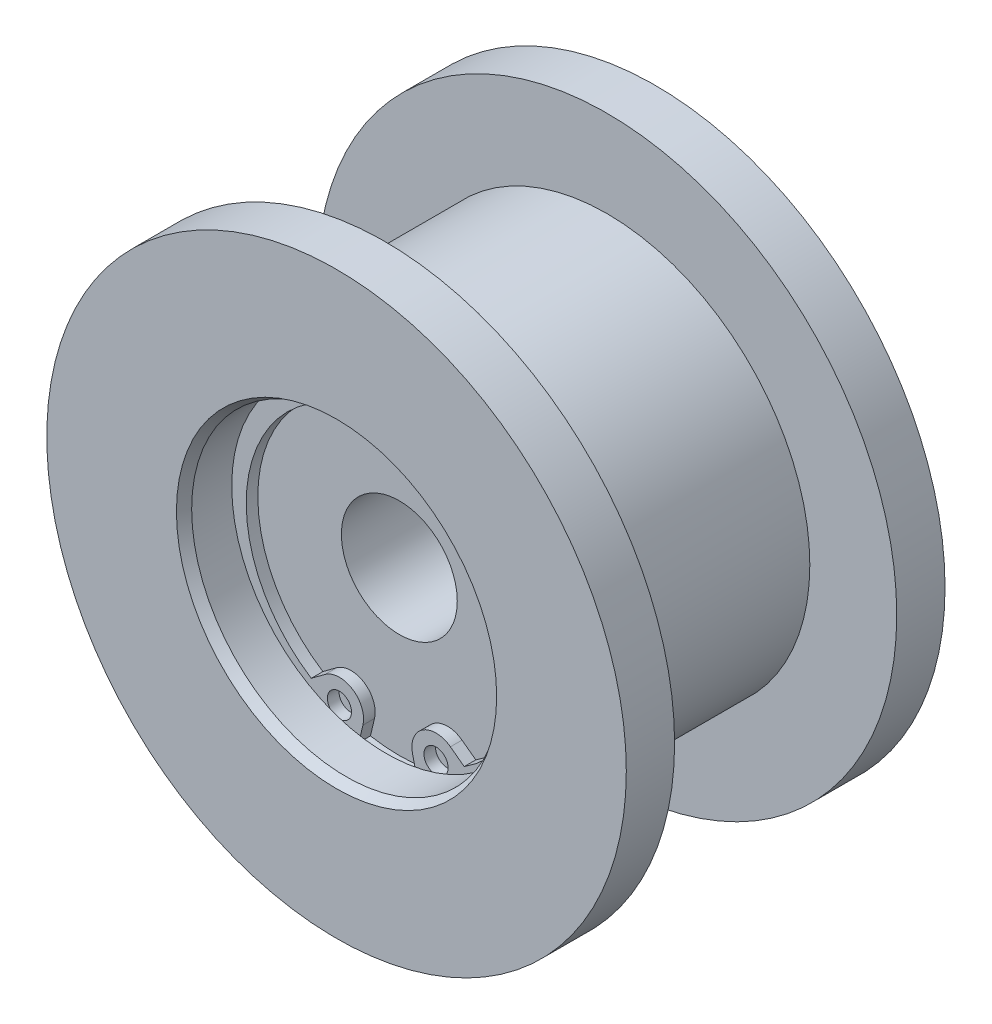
ISO-10303-21;
HEADER;
FILE_DESCRIPTION(('STEP AP214'),'2;1');
FILE_NAME('part.step','',(''),(''),'','','');
FILE_SCHEMA(('AUTOMOTIVE_DESIGN { 1 0 10303 214 1 1 1 1 }'));
ENDSEC;
DATA;
#1=APPLICATION_CONTEXT('core data for automotive mechanical design processes');
#2=APPLICATION_PROTOCOL_DEFINITION('international standard','automotive_design',2000,#1);
#3=PRODUCT_CONTEXT('',#1,'mechanical');
#4=PRODUCT('Part','Part','',(#3));
#5=PRODUCT_RELATED_PRODUCT_CATEGORY('part','',(#4));
#6=PRODUCT_DEFINITION_FORMATION('','',#4);
#7=PRODUCT_DEFINITION_CONTEXT('part definition',#1,'design');
#8=PRODUCT_DEFINITION('design','',#6,#7);
#9=PRODUCT_DEFINITION_SHAPE('','',#8);
#10=(LENGTH_UNIT() NAMED_UNIT(*) SI_UNIT(.MILLI.,.METRE.));
#11=(NAMED_UNIT(*) PLANE_ANGLE_UNIT() SI_UNIT($,.RADIAN.));
#12=(NAMED_UNIT(*) SI_UNIT($,.STERADIAN.) SOLID_ANGLE_UNIT());
#13=UNCERTAINTY_MEASURE_WITH_UNIT(LENGTH_MEASURE(1.E-05),#10,'distance_accuracy_value','');
#14=(GEOMETRIC_REPRESENTATION_CONTEXT(3) GLOBAL_UNCERTAINTY_ASSIGNED_CONTEXT((#13)) GLOBAL_UNIT_ASSIGNED_CONTEXT((#10,
#11,#12)) REPRESENTATION_CONTEXT('',''));
#15=CARTESIAN_POINT('',(0.,0.,0.));
#16=DIRECTION('',(0.,0.,1.));
#17=DIRECTION('',(1.,0.,0.));
#18=AXIS2_PLACEMENT_3D('',#15,#16,#17);
#19=CARTESIAN_POINT('',(0.,-0.95,11.2));
#20=DIRECTION('',(0.,0.,1.));
#21=DIRECTION('',(-1.,0.,0.));
#22=AXIS2_PLACEMENT_3D('',#19,#20,#21);
#23=CYLINDRICAL_SURFACE('',#22,14.65);
#24=CARTESIAN_POINT('',(0.,-0.95,10.));
#25=DIRECTION('',(0.,0.,-1.));
#26=DIRECTION('',(0.,-1.,0.));
#27=AXIS2_PLACEMENT_3D('',#24,#25,#26);
#28=CIRCLE('',#27,14.65);
#29=CARTESIAN_POINT('',(-7.91695293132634,-13.2765711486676,10.));
#30=VERTEX_POINT('',#29);
#31=CARTESIAN_POINT('',(7.91695293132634,-13.2765711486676,10.));
#32=VERTEX_POINT('',#31);
#33=EDGE_CURVE('E161',#30,#32,#28,.T.);
#34=ORIENTED_EDGE('',*,*,#33,.T.);
#35=DIRECTION('',(0.,0.,-1.));
#36=VECTOR('',#35,1.);
#37=CARTESIAN_POINT('',(7.91695293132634,-13.2765711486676,11.2));
#38=LINE('',#37,#36);
#39=CARTESIAN_POINT('',(7.91695293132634,-13.2765711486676,11.2));
#40=VERTEX_POINT('',#39);
#41=EDGE_CURVE('E101',#40,#32,#38,.T.);
#42=ORIENTED_EDGE('',*,*,#41,.F.);
#43=CARTESIAN_POINT('',(0.,-0.95,11.2));
#44=DIRECTION('',(0.,0.,-1.));
#45=DIRECTION('',(0.,-1.,0.));
#46=AXIS2_PLACEMENT_3D('',#43,#44,#45);
#47=CIRCLE('',#46,14.65);
#48=CARTESIAN_POINT('',(-7.91695293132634,-13.2765711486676,11.2));
#49=VERTEX_POINT('',#48);
#50=EDGE_CURVE('E102',#49,#40,#47,.T.);
#51=ORIENTED_EDGE('',*,*,#50,.F.);
#52=DIRECTION('',(0.,0.,-1.));
#53=VECTOR('',#52,1.);
#54=CARTESIAN_POINT('',(-7.91695293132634,-13.2765711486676,11.2));
#55=LINE('',#54,#53);
#56=EDGE_CURVE('E96',#49,#30,#55,.T.);
#57=ORIENTED_EDGE('',*,*,#56,.T.);
#58=EDGE_LOOP('',(#34,#42,#51,#57));
#59=FACE_BOUND('',#58,.T.);
#60=ADVANCED_FACE('F14',(#59),#23,.F.);
#61=CARTESIAN_POINT('',(6.49138441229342,-12.2169439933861,11.2));
#62=DIRECTION('',(-0.596553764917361,-0.802573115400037,0.));
#63=DIRECTION('',(-0.802573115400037,0.596553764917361,0.));
#64=AXIS2_PLACEMENT_3D('',#61,#62,#63);
#65=PLANE('',#64);
#66=DIRECTION('',(-0.802573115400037,0.596553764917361,0.));
#67=VECTOR('',#66,1.);
#68=CARTESIAN_POINT('',(6.49138441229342,-12.2169439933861,10.));
#69=LINE('',#68,#67);
#70=CARTESIAN_POINT('',(6.49138441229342,-12.2169439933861,10.));
#71=VERTEX_POINT('',#70);
#72=EDGE_CURVE('E145',#32,#71,#69,.T.);
#73=ORIENTED_EDGE('',*,*,#72,.T.);
#74=DIRECTION('',(0.,0.,-1.));
#75=VECTOR('',#74,1.);
#76=CARTESIAN_POINT('',(6.49138441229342,-12.2169439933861,11.2));
#77=LINE('',#76,#75);
#78=CARTESIAN_POINT('',(6.49138441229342,-12.2169439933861,11.2));
#79=VERTEX_POINT('',#78);
#80=EDGE_CURVE('E150',#79,#71,#77,.T.);
#81=ORIENTED_EDGE('',*,*,#80,.F.);
#82=DIRECTION('',(-0.802573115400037,0.596553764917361,0.));
#83=VECTOR('',#82,1.);
#84=CARTESIAN_POINT('',(6.49138441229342,-12.2169439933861,11.2));
#85=LINE('',#84,#83);
#86=EDGE_CURVE('E135',#40,#79,#85,.T.);
#87=ORIENTED_EDGE('',*,*,#86,.F.);
#88=ORIENTED_EDGE('',*,*,#41,.T.);
#89=EDGE_LOOP('',(#73,#81,#87,#88));
#90=FACE_BOUND('',#89,.T.);
#91=ADVANCED_FACE('F285',(#90),#65,.F.);
#92=CARTESIAN_POINT('',(5.,-14.2233767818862,11.2));
#93=DIRECTION('',(0.,0.,1.));
#94=DIRECTION('',(-1.,0.,0.));
#95=AXIS2_PLACEMENT_3D('',#92,#93,#94);
#96=CYLINDRICAL_SURFACE('',#95,2.5);
#97=CARTESIAN_POINT('',(5.,-14.2233767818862,10.));
#98=DIRECTION('',(0.,0.,1.));
#99=DIRECTION('',(1.,0.,0.));
#100=AXIS2_PLACEMENT_3D('',#97,#98,#99);
#101=CIRCLE('',#100,2.5);
#102=CARTESIAN_POINT('',(2.5678231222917,-14.8017500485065,10.));
#103=VERTEX_POINT('',#102);
#104=EDGE_CURVE('E131',#71,#103,#101,.T.);
#105=ORIENTED_EDGE('',*,*,#104,.T.);
#106=DIRECTION('',(0.,0.,-1.));
#107=VECTOR('',#106,1.);
#108=CARTESIAN_POINT('',(2.5678231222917,-14.8017500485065,11.2));
#109=LINE('',#108,#107);
#110=CARTESIAN_POINT('',(2.5678231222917,-14.8017500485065,11.2));
#111=VERTEX_POINT('',#110);
#112=EDGE_CURVE('E151',#111,#103,#109,.T.);
#113=ORIENTED_EDGE('',*,*,#112,.F.);
#114=CARTESIAN_POINT('',(5.,-14.2233767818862,11.2));
#115=DIRECTION('',(0.,0.,1.));
#116=DIRECTION('',(1.,0.,0.));
#117=AXIS2_PLACEMENT_3D('',#114,#115,#116);
#118=CIRCLE('',#117,2.5);
#119=EDGE_CURVE('E166',#79,#111,#118,.T.);
#120=ORIENTED_EDGE('',*,*,#119,.F.);
#121=ORIENTED_EDGE('',*,*,#80,.T.);
#122=EDGE_LOOP('',(#105,#113,#120,#121));
#123=FACE_BOUND('',#122,.T.);
#124=ADVANCED_FACE('F282',(#123),#96,.T.);
#125=CARTESIAN_POINT('',(-2.56782312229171,-14.8017500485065,11.2));
#126=DIRECTION('',(-0.97287075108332,0.231349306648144,0.));
#127=DIRECTION('',(0.,0.,1.));
#128=AXIS2_PLACEMENT_3D('',#125,#126,#127);
#129=PLANE('',#128);
#130=DIRECTION('',(0.,0.,1.));
#131=VECTOR('',#130,1.);
#132=CARTESIAN_POINT('',(-2.99125499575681,-16.5823669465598,15.1183293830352));
#133=LINE('',#132,#131);
#134=CARTESIAN_POINT('',(-2.99125499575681,-16.5823669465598,10.));
#135=VERTEX_POINT('',#134);
#136=CARTESIAN_POINT('',(-2.99125499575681,-16.5823669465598,11.2));
#137=VERTEX_POINT('',#136);
#138=EDGE_CURVE('E175',#135,#137,#133,.T.);
#139=ORIENTED_EDGE('',*,*,#138,.F.);
#140=DIRECTION('',(0.231349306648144,0.97287075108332,0.));
#141=VECTOR('',#140,1.);
#142=CARTESIAN_POINT('',(-2.56782312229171,-14.8017500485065,10.));
#143=LINE('',#142,#141);
#144=CARTESIAN_POINT('',(-2.56782312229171,-14.8017500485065,10.));
#145=VERTEX_POINT('',#144);
#146=EDGE_CURVE('E152',#135,#145,#143,.T.);
#147=ORIENTED_EDGE('',*,*,#146,.T.);
#148=DIRECTION('',(0.,0.,-1.));
#149=VECTOR('',#148,1.);
#150=CARTESIAN_POINT('',(-2.56782312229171,-14.8017500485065,11.2));
#151=LINE('',#150,#149);
#152=CARTESIAN_POINT('',(-2.56782312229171,-14.8017500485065,11.2));
#153=VERTEX_POINT('',#152);
#154=EDGE_CURVE('E171',#153,#145,#151,.T.);
#155=ORIENTED_EDGE('',*,*,#154,.F.);
#156=DIRECTION('',(0.231349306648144,0.97287075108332,0.));
#157=VECTOR('',#156,1.);
#158=CARTESIAN_POINT('',(-2.56782312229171,-14.8017500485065,11.2));
#159=LINE('',#158,#157);
#160=EDGE_CURVE('E119',#137,#153,#159,.T.);
#161=ORIENTED_EDGE('',*,*,#160,.F.);
#162=EDGE_LOOP('',(#139,#147,#155,#161));
#163=FACE_BOUND('',#162,.T.);
#164=ADVANCED_FACE('F295',(#163),#129,.F.);
#165=CARTESIAN_POINT('',(0.,-0.95,11.2));
#166=DIRECTION('',(0.,0.,-1.));
#167=DIRECTION('',(0.,-1.,0.));
#168=AXIS2_PLACEMENT_3D('',#165,#166,#167);
#169=PLANE('',#168);
#170=CARTESIAN_POINT('',(5.,-14.2233767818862,11.2));
#171=DIRECTION('',(0.,0.,1.));
#172=DIRECTION('',(1.,0.,0.));
#173=AXIS2_PLACEMENT_3D('',#170,#171,#172);
#174=CIRCLE('',#173,1.25);
#175=CARTESIAN_POINT('',(6.25,-14.2233767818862,11.2));
#176=VERTEX_POINT('',#175);
#177=EDGE_CURVE('E137',#176,#176,#174,.T.);
#178=ORIENTED_EDGE('',*,*,#177,.F.);
#179=EDGE_LOOP('',(#178));
#180=FACE_BOUND('',#179,.T.);
#181=CARTESIAN_POINT('',(-5.,-14.2233767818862,11.2));
#182=DIRECTION('',(0.,0.,-1.));
#183=DIRECTION('',(1.,0.,0.));
#184=AXIS2_PLACEMENT_3D('',#181,#182,#183);
#185=CIRCLE('',#184,1.25);
#186=CARTESIAN_POINT('',(-3.75,-14.2233767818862,11.2));
#187=VERTEX_POINT('',#186);
#188=EDGE_CURVE('E121',#187,#187,#185,.T.);
#189=ORIENTED_EDGE('',*,*,#188,.T.);
#190=EDGE_LOOP('',(#189));
#191=FACE_BOUND('',#190,.T.);
#192=CARTESIAN_POINT('',(0.,0.,11.2));
#193=DIRECTION('',(0.,0.,-1.));
#194=DIRECTION('',(-1.,0.,0.));
#195=AXIS2_PLACEMENT_3D('',#192,#193,#194);
#196=CIRCLE('',#195,16.85);
#197=CARTESIAN_POINT('',(2.99125499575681,-16.5823669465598,11.2));
#198=VERTEX_POINT('',#197);
#199=EDGE_CURVE('E9',#137,#198,#196,.T.);
#200=ORIENTED_EDGE('',*,*,#199,.F.);
#201=ORIENTED_EDGE('',*,*,#160,.T.);
#202=CARTESIAN_POINT('',(-5.,-14.2233767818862,11.2));
#203=DIRECTION('',(0.,0.,1.));
#204=DIRECTION('',(-1.,0.,0.));
#205=AXIS2_PLACEMENT_3D('',#202,#203,#204);
#206=CIRCLE('',#205,2.5);
#207=CARTESIAN_POINT('',(-6.49138441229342,-12.2169439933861,11.2));
#208=VERTEX_POINT('',#207);
#209=EDGE_CURVE('E108',#153,#208,#206,.T.);
#210=ORIENTED_EDGE('',*,*,#209,.T.);
#211=DIRECTION('',(-0.802573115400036,-0.596553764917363,0.));
#212=VECTOR('',#211,1.);
#213=CARTESIAN_POINT('',(-6.49138441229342,-12.2169439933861,11.2));
#214=LINE('',#213,#212);
#215=EDGE_CURVE('E91',#208,#49,#214,.T.);
#216=ORIENTED_EDGE('',*,*,#215,.T.);
#217=ORIENTED_EDGE('',*,*,#50,.T.);
#218=ORIENTED_EDGE('',*,*,#86,.T.);
#219=ORIENTED_EDGE('',*,*,#119,.T.);
#220=DIRECTION('',(0.231349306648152,-0.972870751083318,0.));
#221=VECTOR('',#220,1.);
#222=CARTESIAN_POINT('',(2.5678231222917,-14.8017500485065,11.2));
#223=LINE('',#222,#221);
#224=EDGE_CURVE('E127',#111,#198,#223,.T.);
#225=ORIENTED_EDGE('',*,*,#224,.T.);
#226=EDGE_LOOP('',(#200,#201,#210,#216,#217,#218,#219,#225));
#227=FACE_BOUND('',#226,.T.);
#228=ADVANCED_FACE('F117',(#180,#191,#227),#169,.F.);
#229=CARTESIAN_POINT('',(5.,-14.2233767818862,11.2));
#230=DIRECTION('',(0.,0.,1.));
#231=DIRECTION('',(-1.,0.,0.));
#232=AXIS2_PLACEMENT_3D('',#229,#230,#231);
#233=CYLINDRICAL_SURFACE('',#232,1.25);
#234=CARTESIAN_POINT('',(5.,-14.2233767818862,10.));
#235=DIRECTION('',(0.,0.,1.));
#236=DIRECTION('',(1.,0.,0.));
#237=AXIS2_PLACEMENT_3D('',#234,#235,#236);
#238=CIRCLE('',#237,1.25);
#239=CARTESIAN_POINT('',(6.25,-14.2233767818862,10.));
#240=VERTEX_POINT('',#239);
#241=EDGE_CURVE('E114',#240,#240,#238,.T.);
#242=ORIENTED_EDGE('',*,*,#241,.F.);
#243=EDGE_LOOP('',(#242));
#244=FACE_BOUND('',#243,.T.);
#245=ORIENTED_EDGE('',*,*,#177,.T.);
#246=EDGE_LOOP('',(#245));
#247=FACE_BOUND('',#246,.T.);
#248=ADVANCED_FACE('F303',(#244,#247),#233,.F.);
#249=CARTESIAN_POINT('',(-5.,-14.2233767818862,11.2));
#250=DIRECTION('',(0.,0.,1.));
#251=DIRECTION('',(-1.,0.,0.));
#252=AXIS2_PLACEMENT_3D('',#249,#250,#251);
#253=CYLINDRICAL_SURFACE('',#252,1.25);
#254=CARTESIAN_POINT('',(-5.,-14.2233767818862,10.));
#255=DIRECTION('',(0.,0.,-1.));
#256=DIRECTION('',(1.,0.,0.));
#257=AXIS2_PLACEMENT_3D('',#254,#255,#256);
#258=CIRCLE('',#257,1.25);
#259=CARTESIAN_POINT('',(-3.75,-14.2233767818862,10.));
#260=VERTEX_POINT('',#259);
#261=EDGE_CURVE('E140',#260,#260,#258,.T.);
#262=ORIENTED_EDGE('',*,*,#261,.T.);
#263=EDGE_LOOP('',(#262));
#264=FACE_BOUND('',#263,.T.);
#265=ORIENTED_EDGE('',*,*,#188,.F.);
#266=EDGE_LOOP('',(#265));
#267=FACE_BOUND('',#266,.T.);
#268=ADVANCED_FACE('F527',(#264,#267),#253,.F.);
#269=CARTESIAN_POINT('',(-6.49138441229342,-12.2169439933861,11.2));
#270=DIRECTION('',(0.596553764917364,-0.802573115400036,0.));
#271=DIRECTION('',(0.,0.,-1.));
#272=AXIS2_PLACEMENT_3D('',#269,#270,#271);
#273=PLANE('',#272);
#274=DIRECTION('',(-0.802573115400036,-0.596553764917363,0.));
#275=VECTOR('',#274,1.);
#276=CARTESIAN_POINT('',(-6.49138441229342,-12.2169439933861,10.));
#277=LINE('',#276,#275);
#278=CARTESIAN_POINT('',(-6.49138441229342,-12.2169439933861,10.));
#279=VERTEX_POINT('',#278);
#280=EDGE_CURVE('E113',#279,#30,#277,.T.);
#281=ORIENTED_EDGE('',*,*,#280,.T.);
#282=ORIENTED_EDGE('',*,*,#56,.F.);
#283=ORIENTED_EDGE('',*,*,#215,.F.);
#284=DIRECTION('',(0.,0.,-1.));
#285=VECTOR('',#284,1.);
#286=CARTESIAN_POINT('',(-6.49138441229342,-12.2169439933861,11.2));
#287=LINE('',#286,#285);
#288=EDGE_CURVE('E94',#208,#279,#287,.T.);
#289=ORIENTED_EDGE('',*,*,#288,.T.);
#290=EDGE_LOOP('',(#281,#282,#283,#289));
#291=FACE_BOUND('',#290,.T.);
#292=ADVANCED_FACE('F93',(#291),#273,.F.);
#293=CARTESIAN_POINT('',(-5.,-14.2233767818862,11.2));
#294=DIRECTION('',(0.,0.,1.));
#295=DIRECTION('',(-1.,0.,0.));
#296=AXIS2_PLACEMENT_3D('',#293,#294,#295);
#297=CYLINDRICAL_SURFACE('',#296,2.5);
#298=CARTESIAN_POINT('',(-5.,-14.2233767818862,10.));
#299=DIRECTION('',(0.,0.,1.));
#300=DIRECTION('',(-1.,0.,0.));
#301=AXIS2_PLACEMENT_3D('',#298,#299,#300);
#302=CIRCLE('',#301,2.5);
#303=EDGE_CURVE('E110',#145,#279,#302,.T.);
#304=ORIENTED_EDGE('',*,*,#303,.T.);
#305=ORIENTED_EDGE('',*,*,#288,.F.);
#306=ORIENTED_EDGE('',*,*,#209,.F.);
#307=ORIENTED_EDGE('',*,*,#154,.T.);
#308=EDGE_LOOP('',(#304,#305,#306,#307));
#309=FACE_BOUND('',#308,.T.);
#310=ADVANCED_FACE('F106',(#309),#297,.T.);
#311=CARTESIAN_POINT('',(2.5678231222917,-14.8017500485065,11.2));
#312=DIRECTION('',(0.972870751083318,0.231349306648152,0.));
#313=DIRECTION('',(0.,0.,-1.));
#314=AXIS2_PLACEMENT_3D('',#311,#312,#313);
#315=PLANE('',#314);
#316=DIRECTION('',(0.,0.,1.));
#317=VECTOR('',#316,1.);
#318=CARTESIAN_POINT('',(2.99125499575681,-16.5823669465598,15.1183293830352));
#319=LINE('',#318,#317);
#320=CARTESIAN_POINT('',(2.99125499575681,-16.5823669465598,10.));
#321=VERTEX_POINT('',#320);
#322=EDGE_CURVE('E18',#198,#321,#319,.F.);
#323=ORIENTED_EDGE('',*,*,#322,.F.);
#324=ORIENTED_EDGE('',*,*,#224,.F.);
#325=ORIENTED_EDGE('',*,*,#112,.T.);
#326=DIRECTION('',(0.231349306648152,-0.972870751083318,0.));
#327=VECTOR('',#326,1.);
#328=CARTESIAN_POINT('',(2.5678231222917,-14.8017500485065,10.));
#329=LINE('',#328,#327);
#330=EDGE_CURVE('E32',#103,#321,#329,.T.);
#331=ORIENTED_EDGE('',*,*,#330,.T.);
#332=EDGE_LOOP('',(#323,#324,#325,#331));
#333=FACE_BOUND('',#332,.T.);
#334=ADVANCED_FACE('F264',(#333),#315,.F.);
#335=CARTESIAN_POINT('',(0.,6.,10.));
#336=DIRECTION('',(0.,0.,-1.));
#337=DIRECTION('',(-1.,0.,0.));
#338=AXIS2_PLACEMENT_3D('',#335,#336,#337);
#339=PLANE('',#338);
#340=ORIENTED_EDGE('',*,*,#241,.T.);
#341=EDGE_LOOP('',(#340));
#342=FACE_BOUND('',#341,.T.);
#343=ADVANCED_FACE('F256',(#342),#339,.F.);
#344=ORIENTED_EDGE('',*,*,#261,.F.);
#345=EDGE_LOOP('',(#344));
#346=FACE_BOUND('',#345,.T.);
#347=ADVANCED_FACE('F255',(#346),#339,.F.);
#348=CARTESIAN_POINT('',(0.,0.,15.1183293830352));
#349=DIRECTION('',(0.,0.,1.));
#350=DIRECTION('',(1.,0.,0.));
#351=AXIS2_PLACEMENT_3D('',#348,#349,#350);
#352=CYLINDRICAL_SURFACE('',#351,21.);
#353=CARTESIAN_POINT('',(0.,0.,11.5));
#354=DIRECTION('',(0.,0.,1.));
#355=DIRECTION('',(1.,0.,0.));
#356=AXIS2_PLACEMENT_3D('',#353,#354,#355);
#357=CIRCLE('',#356,21.);
#358=CARTESIAN_POINT('',(21.,0.,11.5));
#359=VERTEX_POINT('',#358);
#360=EDGE_CURVE('E183',#359,#359,#357,.T.);
#361=ORIENTED_EDGE('',*,*,#360,.F.);
#362=EDGE_LOOP('',(#361));
#363=FACE_BOUND('',#362,.T.);
#364=CARTESIAN_POINT('',(0.,0.,-11.5));
#365=DIRECTION('',(0.,0.,1.));
#366=DIRECTION('',(1.,0.,0.));
#367=AXIS2_PLACEMENT_3D('',#364,#365,#366);
#368=CIRCLE('',#367,21.);
#369=CARTESIAN_POINT('',(21.,0.,-11.5));
#370=VERTEX_POINT('',#369);
#371=EDGE_CURVE('E180',#370,#370,#368,.T.);
#372=ORIENTED_EDGE('',*,*,#371,.T.);
#373=EDGE_LOOP('',(#372));
#374=FACE_BOUND('',#373,.T.);
#375=ADVANCED_FACE('F314',(#363,#374),#352,.T.);
#376=CARTESIAN_POINT('',(0.,21.,11.5));
#377=DIRECTION('',(0.,0.,1.));
#378=DIRECTION('',(1.,0.,0.));
#379=AXIS2_PLACEMENT_3D('',#376,#377,#378);
#380=PLANE('',#379);
#381=CARTESIAN_POINT('',(0.,0.,11.5));
#382=DIRECTION('',(0.,0.,1.));
#383=DIRECTION('',(1.,0.,0.));
#384=AXIS2_PLACEMENT_3D('',#381,#382,#383);
#385=CIRCLE('',#384,30.);
#386=CARTESIAN_POINT('',(30.,0.,11.5));
#387=VERTEX_POINT('',#386);
#388=EDGE_CURVE('E186',#387,#387,#385,.T.);
#389=ORIENTED_EDGE('',*,*,#388,.F.);
#390=EDGE_LOOP('',(#389));
#391=FACE_BOUND('',#390,.T.);
#392=ORIENTED_EDGE('',*,*,#360,.T.);
#393=EDGE_LOOP('',(#392));
#394=FACE_BOUND('',#393,.T.);
#395=ADVANCED_FACE('F330',(#391,#394),#380,.F.);
#396=CARTESIAN_POINT('',(0.,30.,-11.5));
#397=DIRECTION('',(0.,0.,-1.));
#398=DIRECTION('',(-1.,0.,0.));
#399=AXIS2_PLACEMENT_3D('',#396,#397,#398);
#400=PLANE('',#399);
#401=ORIENTED_EDGE('',*,*,#371,.F.);
#402=EDGE_LOOP('',(#401));
#403=FACE_BOUND('',#402,.T.);
#404=CARTESIAN_POINT('',(0.,0.,-11.5));
#405=DIRECTION('',(0.,0.,1.));
#406=DIRECTION('',(1.,0.,0.));
#407=AXIS2_PLACEMENT_3D('',#404,#405,#406);
#408=CIRCLE('',#407,30.);
#409=CARTESIAN_POINT('',(30.,0.,-11.5));
#410=VERTEX_POINT('',#409);
#411=EDGE_CURVE('E177',#410,#410,#408,.T.);
#412=ORIENTED_EDGE('',*,*,#411,.T.);
#413=EDGE_LOOP('',(#412));
#414=FACE_BOUND('',#413,.T.);
#415=ADVANCED_FACE('F326',(#403,#414),#400,.F.);
#416=CARTESIAN_POINT('',(0.,0.,15.1183293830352));
#417=DIRECTION('',(0.,0.,1.));
#418=DIRECTION('',(1.,0.,0.));
#419=AXIS2_PLACEMENT_3D('',#416,#417,#418);
#420=CYLINDRICAL_SURFACE('',#419,30.);
#421=CARTESIAN_POINT('',(0.,0.,16.5));
#422=DIRECTION('',(0.,0.,1.));
#423=DIRECTION('',(1.,0.,0.));
#424=AXIS2_PLACEMENT_3D('',#421,#422,#423);
#425=CIRCLE('',#424,30.);
#426=CARTESIAN_POINT('',(30.,0.,16.5));
#427=VERTEX_POINT('',#426);
#428=EDGE_CURVE('E189',#427,#427,#425,.T.);
#429=ORIENTED_EDGE('',*,*,#428,.F.);
#430=EDGE_LOOP('',(#429));
#431=FACE_BOUND('',#430,.T.);
#432=ORIENTED_EDGE('',*,*,#388,.T.);
#433=EDGE_LOOP('',(#432));
#434=FACE_BOUND('',#433,.T.);
#435=ADVANCED_FACE('F329',(#431,#434),#420,.T.);
#436=CARTESIAN_POINT('',(0.,0.,15.1183293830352));
#437=DIRECTION('',(0.,0.,1.));
#438=DIRECTION('',(1.,0.,0.));
#439=AXIS2_PLACEMENT_3D('',#436,#437,#438);
#440=CYLINDRICAL_SURFACE('',#439,30.);
#441=ORIENTED_EDGE('',*,*,#411,.F.);
#442=EDGE_LOOP('',(#441));
#443=FACE_BOUND('',#442,.T.);
#444=CARTESIAN_POINT('',(0.,0.,-16.5));
#445=DIRECTION('',(0.,0.,1.));
#446=DIRECTION('',(1.,0.,0.));
#447=AXIS2_PLACEMENT_3D('',#444,#445,#446);
#448=CIRCLE('',#447,30.);
#449=CARTESIAN_POINT('',(30.,0.,-16.5));
#450=VERTEX_POINT('',#449);
#451=EDGE_CURVE('E141',#450,#450,#448,.T.);
#452=ORIENTED_EDGE('',*,*,#451,.T.);
#453=EDGE_LOOP('',(#452));
#454=FACE_BOUND('',#453,.T.);
#455=ADVANCED_FACE('F16',(#443,#454),#440,.T.);
#456=CARTESIAN_POINT('',(0.,30.,16.5));
#457=DIRECTION('',(0.,0.,-1.));
#458=DIRECTION('',(-1.,0.,0.));
#459=AXIS2_PLACEMENT_3D('',#456,#457,#458);
#460=PLANE('',#459);
#461=CARTESIAN_POINT('',(0.,0.,16.5));
#462=DIRECTION('',(0.,0.,1.));
#463=DIRECTION('',(1.,0.,0.));
#464=AXIS2_PLACEMENT_3D('',#461,#462,#463);
#465=CIRCLE('',#464,16.5773502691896);
#466=CARTESIAN_POINT('',(16.5773502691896,0.,16.5));
#467=VERTEX_POINT('',#466);
#468=EDGE_CURVE('E192',#467,#467,#465,.T.);
#469=ORIENTED_EDGE('',*,*,#468,.F.);
#470=EDGE_LOOP('',(#469));
#471=FACE_BOUND('',#470,.T.);
#472=ORIENTED_EDGE('',*,*,#428,.T.);
#473=EDGE_LOOP('',(#472));
#474=FACE_BOUND('',#473,.T.);
#475=ADVANCED_FACE('F227',(#471,#474),#460,.F.);
#476=CARTESIAN_POINT('',(0.,13.,-16.5));
#477=DIRECTION('',(0.,0.,1.));
#478=DIRECTION('',(1.,0.,0.));
#479=AXIS2_PLACEMENT_3D('',#476,#477,#478);
#480=PLANE('',#479);
#481=ORIENTED_EDGE('',*,*,#451,.F.);
#482=EDGE_LOOP('',(#481));
#483=FACE_BOUND('',#482,.T.);
#484=CARTESIAN_POINT('',(0.,0.,-16.5));
#485=DIRECTION('',(0.,0.,1.));
#486=DIRECTION('',(1.,0.,0.));
#487=AXIS2_PLACEMENT_3D('',#484,#485,#486);
#488=CIRCLE('',#487,13.);
#489=CARTESIAN_POINT('',(13.,0.,-16.5));
#490=VERTEX_POINT('',#489);
#491=EDGE_CURVE('E216',#490,#490,#488,.T.);
#492=ORIENTED_EDGE('',*,*,#491,.T.);
#493=EDGE_LOOP('',(#492));
#494=FACE_BOUND('',#493,.T.);
#495=ADVANCED_FACE('F223',(#483,#494),#480,.F.);
#496=CARTESIAN_POINT('',(0.,0.,16.5));
#497=DIRECTION('',(0.,0.,1.));
#498=DIRECTION('',(1.,0.,0.));
#499=AXIS2_PLACEMENT_3D('',#496,#497,#498);
#500=CONICAL_SURFACE('',#499,16.5773502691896,0.523598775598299);
#501=CARTESIAN_POINT('',(0.,0.,15.5));
#502=DIRECTION('',(0.,0.,1.));
#503=DIRECTION('',(1.,0.,0.));
#504=AXIS2_PLACEMENT_3D('',#501,#502,#503);
#505=CIRCLE('',#504,16.);
#506=CARTESIAN_POINT('',(16.,0.,15.5));
#507=VERTEX_POINT('',#506);
#508=EDGE_CURVE('E195',#507,#507,#505,.T.);
#509=ORIENTED_EDGE('',*,*,#508,.F.);
#510=EDGE_LOOP('',(#509));
#511=FACE_BOUND('',#510,.T.);
#512=ORIENTED_EDGE('',*,*,#468,.T.);
#513=EDGE_LOOP('',(#512));
#514=FACE_BOUND('',#513,.T.);
#515=ADVANCED_FACE('F226',(#511,#514),#500,.F.);
#516=CARTESIAN_POINT('',(0.,0.,15.1183293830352));
#517=DIRECTION('',(0.,0.,1.));
#518=DIRECTION('',(1.,0.,0.));
#519=AXIS2_PLACEMENT_3D('',#516,#517,#518);
#520=CYLINDRICAL_SURFACE('',#519,13.);
#521=ORIENTED_EDGE('',*,*,#491,.F.);
#522=EDGE_LOOP('',(#521));
#523=FACE_BOUND('',#522,.T.);
#524=CARTESIAN_POINT('',(0.,0.,-10.));
#525=DIRECTION('',(0.,0.,1.));
#526=DIRECTION('',(1.,0.,0.));
#527=AXIS2_PLACEMENT_3D('',#524,#525,#526);
#528=CIRCLE('',#527,13.);
#529=CARTESIAN_POINT('',(13.,0.,-10.));
#530=VERTEX_POINT('',#529);
#531=EDGE_CURVE('E213',#530,#530,#528,.T.);
#532=ORIENTED_EDGE('',*,*,#531,.T.);
#533=EDGE_LOOP('',(#532));
#534=FACE_BOUND('',#533,.T.);
#535=ADVANCED_FACE('F230',(#523,#534),#520,.F.);
#536=CARTESIAN_POINT('',(0.,0.,15.1183293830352));
#537=DIRECTION('',(0.,0.,1.));
#538=DIRECTION('',(1.,0.,0.));
#539=AXIS2_PLACEMENT_3D('',#536,#537,#538);
#540=CYLINDRICAL_SURFACE('',#539,16.);
#541=CARTESIAN_POINT('',(0.,0.,11.35));
#542=DIRECTION('',(0.,0.,1.));
#543=DIRECTION('',(1.,0.,0.));
#544=AXIS2_PLACEMENT_3D('',#541,#542,#543);
#545=CIRCLE('',#544,16.);
#546=CARTESIAN_POINT('',(16.,0.,11.35));
#547=VERTEX_POINT('',#546);
#548=EDGE_CURVE('E198',#547,#547,#545,.T.);
#549=ORIENTED_EDGE('',*,*,#548,.F.);
#550=EDGE_LOOP('',(#549));
#551=FACE_BOUND('',#550,.T.);
#552=ORIENTED_EDGE('',*,*,#508,.T.);
#553=EDGE_LOOP('',(#552));
#554=FACE_BOUND('',#553,.T.);
#555=ADVANCED_FACE('F233',(#551,#554),#540,.F.);
#556=CARTESIAN_POINT('',(0.,13.,-10.));
#557=DIRECTION('',(0.,0.,1.));
#558=DIRECTION('',(1.,0.,0.));
#559=AXIS2_PLACEMENT_3D('',#556,#557,#558);
#560=PLANE('',#559);
#561=ORIENTED_EDGE('',*,*,#531,.F.);
#562=EDGE_LOOP('',(#561));
#563=FACE_BOUND('',#562,.T.);
#564=CARTESIAN_POINT('',(0.,0.,-10.));
#565=DIRECTION('',(0.,0.,1.));
#566=DIRECTION('',(1.,0.,0.));
#567=AXIS2_PLACEMENT_3D('',#564,#565,#566);
#568=CIRCLE('',#567,6.);
#569=CARTESIAN_POINT('',(6.,0.,-10.));
#570=VERTEX_POINT('',#569);
#571=EDGE_CURVE('E210',#570,#570,#568,.T.);
#572=ORIENTED_EDGE('',*,*,#571,.T.);
#573=EDGE_LOOP('',(#572));
#574=FACE_BOUND('',#573,.T.);
#575=ADVANCED_FACE('F237',(#563,#574),#560,.F.);
#576=CARTESIAN_POINT('',(0.,16.85,11.35));
#577=DIRECTION('',(0.,0.,1.));
#578=DIRECTION('',(1.,0.,0.));
#579=AXIS2_PLACEMENT_3D('',#576,#577,#578);
#580=PLANE('',#579);
#581=CARTESIAN_POINT('',(0.,0.,11.35));
#582=DIRECTION('',(0.,0.,1.));
#583=DIRECTION('',(1.,0.,0.));
#584=AXIS2_PLACEMENT_3D('',#581,#582,#583);
#585=CIRCLE('',#584,16.85);
#586=CARTESIAN_POINT('',(16.85,0.,11.35));
#587=VERTEX_POINT('',#586);
#588=EDGE_CURVE('E201',#587,#587,#585,.T.);
#589=ORIENTED_EDGE('',*,*,#588,.F.);
#590=EDGE_LOOP('',(#589));
#591=FACE_BOUND('',#590,.T.);
#592=ORIENTED_EDGE('',*,*,#548,.T.);
#593=EDGE_LOOP('',(#592));
#594=FACE_BOUND('',#593,.T.);
#595=ADVANCED_FACE('F240',(#591,#594),#580,.F.);
#596=CARTESIAN_POINT('',(0.,0.,15.1183293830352));
#597=DIRECTION('',(0.,0.,1.));
#598=DIRECTION('',(1.,0.,0.));
#599=AXIS2_PLACEMENT_3D('',#596,#597,#598);
#600=CYLINDRICAL_SURFACE('',#599,16.85);
#601=ORIENTED_EDGE('',*,*,#588,.T.);
#602=EDGE_LOOP('',(#601));
#603=FACE_BOUND('',#602,.T.);
#604=ORIENTED_EDGE('',*,*,#199,.T.);
#605=ORIENTED_EDGE('',*,*,#322,.T.);
#606=CARTESIAN_POINT('',(0.,0.,10.));
#607=DIRECTION('',(0.,0.,1.));
#608=DIRECTION('',(1.,0.,0.));
#609=AXIS2_PLACEMENT_3D('',#606,#607,#608);
#610=CIRCLE('',#609,16.85);
#611=EDGE_CURVE('E204',#135,#321,#610,.T.);
#612=ORIENTED_EDGE('',*,*,#611,.F.);
#613=ORIENTED_EDGE('',*,*,#138,.T.);
#614=EDGE_LOOP('',(#604,#605,#612,#613));
#615=FACE_BOUND('',#614,.T.);
#616=ADVANCED_FACE('F248',(#603,#615),#600,.F.);
#617=CARTESIAN_POINT('',(0.,0.,15.1183293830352));
#618=DIRECTION('',(0.,0.,1.));
#619=DIRECTION('',(1.,0.,0.));
#620=AXIS2_PLACEMENT_3D('',#617,#618,#619);
#621=CYLINDRICAL_SURFACE('',#620,6.);
#622=ORIENTED_EDGE('',*,*,#571,.F.);
#623=EDGE_LOOP('',(#622));
#624=FACE_BOUND('',#623,.T.);
#625=CARTESIAN_POINT('',(0.,0.,10.));
#626=DIRECTION('',(0.,0.,1.));
#627=DIRECTION('',(1.,0.,0.));
#628=AXIS2_PLACEMENT_3D('',#625,#626,#627);
#629=CIRCLE('',#628,6.);
#630=CARTESIAN_POINT('',(6.,0.,10.));
#631=VERTEX_POINT('',#630);
#632=EDGE_CURVE('E207',#631,#631,#629,.T.);
#633=ORIENTED_EDGE('',*,*,#632,.T.);
#634=EDGE_LOOP('',(#633));
#635=FACE_BOUND('',#634,.T.);
#636=ADVANCED_FACE('F244',(#624,#635),#621,.F.);
#637=ORIENTED_EDGE('',*,*,#632,.F.);
#638=EDGE_LOOP('',(#637));
#639=FACE_BOUND('',#638,.T.);
#640=ORIENTED_EDGE('',*,*,#611,.T.);
#641=ORIENTED_EDGE('',*,*,#330,.F.);
#642=ORIENTED_EDGE('',*,*,#104,.F.);
#643=ORIENTED_EDGE('',*,*,#72,.F.);
#644=ORIENTED_EDGE('',*,*,#33,.F.);
#645=ORIENTED_EDGE('',*,*,#280,.F.);
#646=ORIENTED_EDGE('',*,*,#303,.F.);
#647=ORIENTED_EDGE('',*,*,#146,.F.);
#648=EDGE_LOOP('',(#640,#641,#642,#643,#644,#645,#646,#647));
#649=FACE_BOUND('',#648,.T.);
#650=ADVANCED_FACE('F247',(#639,#649),#339,.F.);
#651=CLOSED_SHELL('',(#60,#91,#124,#164,#228,#248,#268,#292,#310,#334,#343,#347,#375,#395,#415,
#435,#455,#475,#495,#515,#535,#555,#575,#595,#616,#636,#650));
#652=MANIFOLD_SOLID_BREP('B1',#651);
#653=ADVANCED_BREP_SHAPE_REPRESENTATION('',(#18,#652),#14);
#654=SHAPE_DEFINITION_REPRESENTATION(#9,#653);
ENDSEC;
END-ISO-10303-21;
